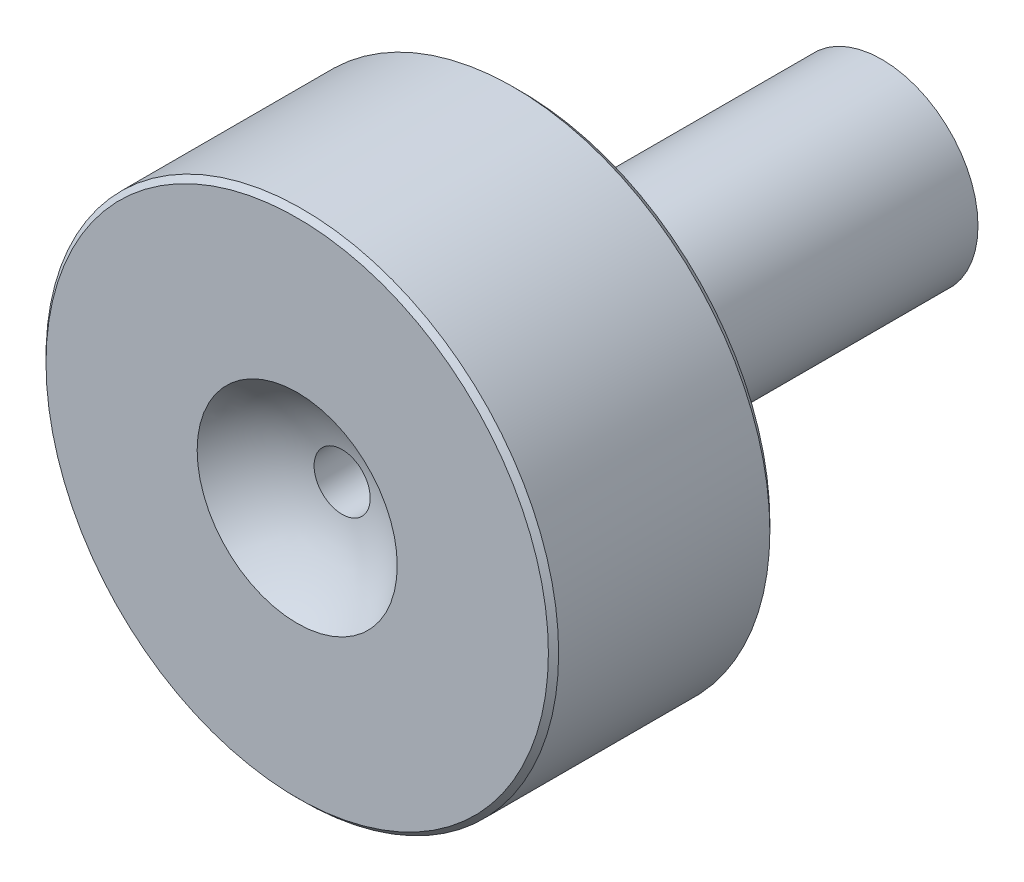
ISO-10303-21;
HEADER;
FILE_DESCRIPTION(('STEP AP214'),'2;1');
FILE_NAME('part.step','',(''),(''),'','','');
FILE_SCHEMA(('AUTOMOTIVE_DESIGN { 1 0 10303 214 1 1 1 1 }'));
ENDSEC;
DATA;
#1=APPLICATION_CONTEXT('core data for automotive mechanical design processes');
#2=APPLICATION_PROTOCOL_DEFINITION('international standard','automotive_design',2000,#1);
#3=PRODUCT_CONTEXT('',#1,'mechanical');
#4=PRODUCT('Part','Part','',(#3));
#5=PRODUCT_RELATED_PRODUCT_CATEGORY('part','',(#4));
#6=PRODUCT_DEFINITION_FORMATION('','',#4);
#7=PRODUCT_DEFINITION_CONTEXT('part definition',#1,'design');
#8=PRODUCT_DEFINITION('design','',#6,#7);
#9=PRODUCT_DEFINITION_SHAPE('','',#8);
#10=(LENGTH_UNIT() NAMED_UNIT(*) SI_UNIT(.MILLI.,.METRE.));
#11=(NAMED_UNIT(*) PLANE_ANGLE_UNIT() SI_UNIT($,.RADIAN.));
#12=(NAMED_UNIT(*) SI_UNIT($,.STERADIAN.) SOLID_ANGLE_UNIT());
#13=UNCERTAINTY_MEASURE_WITH_UNIT(LENGTH_MEASURE(1.E-05),#10,'distance_accuracy_value','');
#14=(GEOMETRIC_REPRESENTATION_CONTEXT(3) GLOBAL_UNCERTAINTY_ASSIGNED_CONTEXT((#13)) GLOBAL_UNIT_ASSIGNED_CONTEXT((#10,
#11,#12)) REPRESENTATION_CONTEXT('',''));
#15=CARTESIAN_POINT('',(0.,0.,0.));
#16=DIRECTION('',(0.,0.,1.));
#17=DIRECTION('',(1.,0.,0.));
#18=AXIS2_PLACEMENT_3D('',#15,#16,#17);
#19=CARTESIAN_POINT('',(0.,0.,22.225));
#20=DIRECTION('',(0.,0.,-1.));
#21=DIRECTION('',(-1.,0.,0.));
#22=AXIS2_PLACEMENT_3D('',#19,#20,#21);
#23=CYLINDRICAL_SURFACE('',#22,25.4);
#24=CARTESIAN_POINT('',(0.,0.,21.717));
#25=DIRECTION('',(0.,0.,1.));
#26=DIRECTION('',(1.,0.,0.));
#27=AXIS2_PLACEMENT_3D('',#24,#25,#26);
#28=CIRCLE('',#27,25.4);
#29=CARTESIAN_POINT('',(25.4,0.,21.717));
#30=VERTEX_POINT('',#29);
#31=EDGE_CURVE('E10',#30,#30,#28,.F.);
#32=ORIENTED_EDGE('',*,*,#31,.T.);
#33=EDGE_LOOP('',(#32));
#34=FACE_BOUND('',#33,.T.);
#35=CARTESIAN_POINT('',(0.,0.,0.787399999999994));
#36=DIRECTION('',(0.,0.,1.));
#37=DIRECTION('',(1.,0.,0.));
#38=AXIS2_PLACEMENT_3D('',#35,#36,#37);
#39=CIRCLE('',#38,25.4);
#40=CARTESIAN_POINT('',(25.4,0.,0.787399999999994));
#41=VERTEX_POINT('',#40);
#42=EDGE_CURVE('E46',#41,#41,#39,.T.);
#43=ORIENTED_EDGE('',*,*,#42,.T.);
#44=EDGE_LOOP('',(#43));
#45=FACE_BOUND('',#44,.T.);
#46=ADVANCED_FACE('F31',(#34,#45),#23,.T.);
#47=CARTESIAN_POINT('',(0.,0.,22.225));
#48=DIRECTION('',(0.,0.,1.));
#49=DIRECTION('',(1.,0.,0.));
#50=AXIS2_PLACEMENT_3D('',#47,#48,#49);
#51=PLANE('',#50);
#52=CARTESIAN_POINT('',(0.,0.,22.225));
#53=DIRECTION('',(0.,0.,1.));
#54=DIRECTION('',(1.,0.,0.));
#55=AXIS2_PLACEMENT_3D('',#52,#53,#54);
#56=CIRCLE('',#55,24.892);
#57=CARTESIAN_POINT('',(24.892,0.,22.225));
#58=VERTEX_POINT('',#57);
#59=EDGE_CURVE('E38',#58,#58,#56,.T.);
#60=ORIENTED_EDGE('',*,*,#59,.T.);
#61=EDGE_LOOP('',(#60));
#62=FACE_BOUND('',#61,.T.);
#63=CARTESIAN_POINT('',(0.,0.,22.225));
#64=DIRECTION('',(0.,0.,-1.));
#65=DIRECTION('',(-1.,0.,0.));
#66=AXIS2_PLACEMENT_3D('',#63,#64,#65);
#67=CIRCLE('',#66,9.91393432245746);
#68=CARTESIAN_POINT('',(9.91393432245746,0.,22.225));
#69=VERTEX_POINT('',#68);
#70=EDGE_CURVE('E60',#69,#69,#67,.T.);
#71=ORIENTED_EDGE('',*,*,#70,.T.);
#72=EDGE_LOOP('',(#71));
#73=FACE_BOUND('',#72,.T.);
#74=ADVANCED_FACE('F88',(#62,#73),#51,.T.);
#75=CARTESIAN_POINT('',(0.,0.,0.));
#76=DIRECTION('',(0.,0.,1.));
#77=DIRECTION('',(1.,0.,0.));
#78=AXIS2_PLACEMENT_3D('',#75,#76,#77);
#79=PLANE('',#78);
#80=CARTESIAN_POINT('',(0.,0.,0.));
#81=DIRECTION('',(0.,0.,1.));
#82=DIRECTION('',(1.,0.,0.));
#83=AXIS2_PLACEMENT_3D('',#80,#81,#82);
#84=CIRCLE('',#83,24.6126);
#85=CARTESIAN_POINT('',(24.6126,0.,0.));
#86=VERTEX_POINT('',#85);
#87=EDGE_CURVE('E42',#86,#86,#84,.F.);
#88=ORIENTED_EDGE('',*,*,#87,.T.);
#89=EDGE_LOOP('',(#88));
#90=FACE_BOUND('',#89,.T.);
#91=CARTESIAN_POINT('',(0.,0.,0.));
#92=DIRECTION('',(0.,0.,1.));
#93=DIRECTION('',(1.,0.,0.));
#94=AXIS2_PLACEMENT_3D('',#91,#92,#93);
#95=CIRCLE('',#94,12.7);
#96=CARTESIAN_POINT('',(12.7,0.,0.));
#97=VERTEX_POINT('',#96);
#98=EDGE_CURVE('E51',#97,#97,#95,.T.);
#99=ORIENTED_EDGE('',*,*,#98,.T.);
#100=EDGE_LOOP('',(#99));
#101=FACE_BOUND('',#100,.T.);
#102=ADVANCED_FACE('F82',(#90,#101),#79,.F.);
#103=CARTESIAN_POINT('',(0.,0.,-35.7124));
#104=DIRECTION('',(0.,0.,1.));
#105=DIRECTION('',(1.,0.,0.));
#106=AXIS2_PLACEMENT_3D('',#103,#104,#105);
#107=CYLINDRICAL_SURFACE('',#106,9.525);
#108=CARTESIAN_POINT('',(0.,0.,-3.175));
#109=DIRECTION('',(0.,0.,1.));
#110=DIRECTION('',(1.,0.,0.));
#111=AXIS2_PLACEMENT_3D('',#108,#109,#110);
#112=CIRCLE('',#111,9.525);
#113=CARTESIAN_POINT('',(9.525,0.,-3.175));
#114=VERTEX_POINT('',#113);
#115=EDGE_CURVE('E54',#114,#114,#112,.F.);
#116=ORIENTED_EDGE('',*,*,#115,.T.);
#117=EDGE_LOOP('',(#116));
#118=FACE_BOUND('',#117,.T.);
#119=CARTESIAN_POINT('',(0.,0.,-35.7124));
#120=DIRECTION('',(0.,0.,-1.));
#121=DIRECTION('',(-1.,0.,0.));
#122=AXIS2_PLACEMENT_3D('',#119,#120,#121);
#123=CIRCLE('',#122,9.525);
#124=CARTESIAN_POINT('',(-9.525,0.,-35.7124));
#125=VERTEX_POINT('',#124);
#126=EDGE_CURVE('E57',#125,#125,#123,.T.);
#127=ORIENTED_EDGE('',*,*,#126,.F.);
#128=EDGE_LOOP('',(#127));
#129=FACE_BOUND('',#128,.T.);
#130=ADVANCED_FACE('F77',(#118,#129),#107,.T.);
#131=CARTESIAN_POINT('',(0.,0.,-35.7124));
#132=DIRECTION('',(0.,0.,-1.));
#133=DIRECTION('',(-1.,0.,0.));
#134=AXIS2_PLACEMENT_3D('',#131,#132,#133);
#135=PLANE('',#134);
#136=CARTESIAN_POINT('',(0.,0.,-35.7124));
#137=DIRECTION('',(0.,0.,-1.));
#138=DIRECTION('',(-1.,0.,0.));
#139=AXIS2_PLACEMENT_3D('',#136,#137,#138);
#140=CIRCLE('',#139,3.89694388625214);
#141=CARTESIAN_POINT('',(-3.89694388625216,0.,-35.7124));
#142=VERTEX_POINT('',#141);
#143=EDGE_CURVE('E66',#142,#142,#140,.T.);
#144=ORIENTED_EDGE('',*,*,#143,.F.);
#145=EDGE_LOOP('',(#144));
#146=FACE_BOUND('',#145,.T.);
#147=ORIENTED_EDGE('',*,*,#126,.T.);
#148=EDGE_LOOP('',(#147));
#149=FACE_BOUND('',#148,.T.);
#150=ADVANCED_FACE('F73',(#146,#149),#135,.T.);
#151=CARTESIAN_POINT('',(0.,0.,30.1625));
#152=DIRECTION('',(0.,0.,-1.));
#153=DIRECTION('',(1.,0.,0.));
#154=AXIS2_PLACEMENT_3D('',#151,#152,#153);
#155=SPHERICAL_SURFACE('',#154,12.7);
#156=CARTESIAN_POINT('',(0.,0.,17.7707942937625));
#157=DIRECTION('',(0.,0.,-1.));
#158=DIRECTION('',(-1.,0.,0.));
#159=AXIS2_PLACEMENT_3D('',#156,#157,#158);
#160=CIRCLE('',#159,2.7813);
#161=CARTESIAN_POINT('',(2.78129999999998,0.,17.7707942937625));
#162=VERTEX_POINT('',#161);
#163=EDGE_CURVE('E63',#162,#162,#160,.T.);
#164=CARTESIAN_POINT('',(2.78129999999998,0.,17.7707942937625));
#165=CARTESIAN_POINT('',(2.86841312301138,0.,17.7903465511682));
#166=CARTESIAN_POINT('',(2.95531999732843,0.,17.8108176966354));
#167=CARTESIAN_POINT('',(3.12868275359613,0.,17.8535880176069));
#168=CARTESIAN_POINT('',(3.21513863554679,0.,17.8758871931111));
#169=CARTESIAN_POINT('',(3.38756091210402,0.,17.9223038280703));
#170=CARTESIAN_POINT('',(3.4735273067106,0.,17.9464212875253));
#171=CARTESIAN_POINT('',(3.64493238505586,0.,17.9964637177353));
#172=CARTESIAN_POINT('',(3.73037106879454,0.,18.0223886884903));
#173=CARTESIAN_POINT('',(3.90068272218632,0.,18.076034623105));
#174=CARTESIAN_POINT('',(3.98555569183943,0.,18.1037555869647));
#175=CARTESIAN_POINT('',(4.15469816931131,0.,18.1609811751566));
#176=CARTESIAN_POINT('',(4.23896767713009,0.,18.1904857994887));
#177=CARTESIAN_POINT('',(4.40686575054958,0.,18.2512655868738));
#178=CARTESIAN_POINT('',(4.49049431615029,0.,18.2825407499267));
#179=CARTESIAN_POINT('',(4.65707331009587,0.,18.3468477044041));
#180=CARTESIAN_POINT('',(4.74002373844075,0.,18.3798794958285));
#181=CARTESIAN_POINT('',(4.90520956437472,0.,18.4476850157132));
#182=CARTESIAN_POINT('',(4.98744496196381,0.,18.4824587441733));
#183=CARTESIAN_POINT('',(5.15116415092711,0.,18.5537326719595));
#184=CARTESIAN_POINT('',(5.23264794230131,0.,18.5902328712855));
#185=CARTESIAN_POINT('',(5.39482767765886,0.,18.6649435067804));
#186=CARTESIAN_POINT('',(5.47552362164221,0.,18.7031539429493));
#187=CARTESIAN_POINT('',(5.63609177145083,0.,18.7812680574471));
#188=CARTESIAN_POINT('',(5.71596397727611,0.,18.821171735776));
#189=CARTESIAN_POINT('',(5.87484912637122,0.,18.9026545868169));
#190=CARTESIAN_POINT('',(5.95386206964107,0.,18.9442337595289));
#191=CARTESIAN_POINT('',(6.11099355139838,0.,19.0290491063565));
#192=CARTESIAN_POINT('',(6.18911208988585,0.,19.0722852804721));
#193=CARTESIAN_POINT('',(6.34442001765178,0.,19.1603954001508));
#194=CARTESIAN_POINT('',(6.42160940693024,0.,19.2052693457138));
#195=CARTESIAN_POINT('',(6.57502470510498,0.,19.2966350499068));
#196=CARTESIAN_POINT('',(6.65125061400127,0.,19.3431268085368));
#197=CARTESIAN_POINT('',(6.80270504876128,0.,19.437707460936));
#198=CARTESIAN_POINT('',(6.877933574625,0.,19.4857963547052));
#199=CARTESIAN_POINT('',(7.02735978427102,0.,19.5835498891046));
#200=CARTESIAN_POINT('',(7.10155746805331,0.,19.6332145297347));
#201=CARTESIAN_POINT('',(7.24888899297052,0.,19.7340974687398));
#202=CARTESIAN_POINT('',(7.32202283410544,0.,19.7853157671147));
#203=CARTESIAN_POINT('',(7.46719414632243,0.,19.8892832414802));
#204=CARTESIAN_POINT('',(7.53923161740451,0.,19.9420324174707));
#205=CARTESIAN_POINT('',(7.68217814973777,0.,20.0490381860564));
#206=CARTESIAN_POINT('',(7.75308721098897,0.,20.1032947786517));
#207=CARTESIAN_POINT('',(7.89374538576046,0.,20.2132912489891));
#208=CARTESIAN_POINT('',(7.96349449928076,0.,20.2690311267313));
#209=CARTESIAN_POINT('',(8.1018017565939,0.,20.3819693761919));
#210=CARTESIAN_POINT('',(8.17035990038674,0.,20.4391677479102));
#211=CARTESIAN_POINT('',(8.30625472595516,0.,20.5549975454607));
#212=CARTESIAN_POINT('',(8.37359140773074,0.,20.6136289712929));
#213=CARTESIAN_POINT('',(8.50701336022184,0.,20.73229879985));
#214=CARTESIAN_POINT('',(8.57309863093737,0.,20.7923372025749));
#215=CARTESIAN_POINT('',(8.70398836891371,0.,20.9137942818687));
#216=CARTESIAN_POINT('',(8.76879283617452,0.,20.9752129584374));
#217=CARTESIAN_POINT('',(8.89709214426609,0.,21.0994032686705));
#218=CARTESIAN_POINT('',(8.96058698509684,0.,21.1621749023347));
#219=CARTESIAN_POINT('',(9.08623880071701,0.,21.28904320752));
#220=CARTESIAN_POINT('',(9.14839577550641,0.,21.3531398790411));
#221=CARTESIAN_POINT('',(9.27134421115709,0.,21.4826297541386));
#222=CARTESIAN_POINT('',(9.33213567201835,0.,21.5480229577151));
#223=CARTESIAN_POINT('',(9.45232605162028,0.,21.6800768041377));
#224=CARTESIAN_POINT('',(9.51172497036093,0.,21.7467374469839));
#225=CARTESIAN_POINT('',(9.62910381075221,0.,21.8812965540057));
#226=CARTESIAN_POINT('',(9.68708373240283,0.,21.9491950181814));
#227=CARTESIAN_POINT('',(9.80159892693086,0.,22.086199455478));
#228=CARTESIAN_POINT('',(9.85813419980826,0.,22.1553054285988));
#229=CARTESIAN_POINT('',(9.91393432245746,0.,22.225));
#230=B_SPLINE_CURVE_WITH_KNOTS('',3,(#164,#165,#166,#167,#168,#169,#170,#171,#172,#173,#174,
#175,#176,#177,#178,#179,#180,#181,#182,#183,#184,#185,#186,#187,#188,#189,#190,#191,#192,#193,
#194,#195,#196,#197,#198,#199,#200,#201,#202,#203,#204,#205,#206,#207,#208,#209,#210,#211,#212,
#213,#214,#215,#216,#217,#218,#219,#220,#221,#222,#223,#224,#225,#226,#227,#228,#229),
.UNSPECIFIED.,.F.,.F.,(4,2,2,2,2,2,2,2,2,2,2,2,2,2,2,2,2,2,2,2,2,2,2,2,2,2,2,2,2,2,2,2,4),(0.,
0.267836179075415,0.53567235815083,0.803508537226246,1.07134471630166,1.33918089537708,
1.6070170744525,1.87485325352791,2.14268943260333,2.41052561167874,2.67836179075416,
2.94619796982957,3.21403414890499,3.48187032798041,3.74970650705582,4.01754268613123,
4.28537886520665,4.55321504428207,4.82105122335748,5.0888874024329,5.35672358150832,
5.62455976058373,5.89239593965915,6.16023211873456,6.42806829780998,6.6959044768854,
6.96374065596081,7.23157683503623,7.49941301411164,7.76724919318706,8.03508537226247,
8.30292155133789,8.57075773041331),.UNSPECIFIED.);
#231=EDGE_CURVE('BSEAM76',#162,#69,#230,.T.);
#232=ORIENTED_EDGE('',*,*,#163,.T.);
#233=ORIENTED_EDGE('',*,*,#70,.F.);
#234=ORIENTED_EDGE('',*,*,#231,.T.);
#235=ORIENTED_EDGE('',*,*,#231,.F.);
#236=EDGE_LOOP('',(#232,#234,#233,#235));
#237=FACE_BOUND('',#236,.T.);
#238=ADVANCED_FACE('F76',(#237),#155,.F.);
#239=CARTESIAN_POINT('',(0.,0.,17.7707942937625));
#240=DIRECTION('',(0.,0.,-1.));
#241=DIRECTION('',(-1.,0.,0.));
#242=AXIS2_PLACEMENT_3D('',#239,#240,#241);
#243=CONICAL_SURFACE('',#242,2.7813,0.0208566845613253);
#244=ORIENTED_EDGE('',*,*,#143,.T.);
#245=EDGE_LOOP('',(#244));
#246=FACE_BOUND('',#245,.T.);
#247=ORIENTED_EDGE('',*,*,#163,.F.);
#248=EDGE_LOOP('',(#247));
#249=FACE_BOUND('',#248,.T.);
#250=ADVANCED_FACE('F70',(#246,#249),#243,.F.);
#251=CARTESIAN_POINT('',(0.,0.,-3.175));
#252=DIRECTION('',(0.,0.,1.));
#253=DIRECTION('',(1.,0.,0.));
#254=AXIS2_PLACEMENT_3D('',#251,#252,#253);
#255=TOROIDAL_SURFACE('',#254,12.7,3.175);
#256=ORIENTED_EDGE('',*,*,#98,.F.);
#257=EDGE_LOOP('',(#256));
#258=FACE_BOUND('',#257,.T.);
#259=ORIENTED_EDGE('',*,*,#115,.F.);
#260=EDGE_LOOP('',(#259));
#261=FACE_BOUND('',#260,.T.);
#262=ADVANCED_FACE('F99',(#258,#261),#255,.F.);
#263=CARTESIAN_POINT('',(0.,0.,0.787399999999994));
#264=DIRECTION('',(0.,0.,1.));
#265=DIRECTION('',(1.,0.,0.));
#266=AXIS2_PLACEMENT_3D('',#263,#264,#265);
#267=CONICAL_SURFACE('',#266,25.4,0.78539816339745);
#268=ORIENTED_EDGE('',*,*,#87,.F.);
#269=EDGE_LOOP('',(#268));
#270=FACE_BOUND('',#269,.T.);
#271=ORIENTED_EDGE('',*,*,#42,.F.);
#272=EDGE_LOOP('',(#271));
#273=FACE_BOUND('',#272,.T.);
#274=ADVANCED_FACE('F101',(#270,#273),#267,.T.);
#275=CARTESIAN_POINT('',(0.,0.,22.225));
#276=DIRECTION('',(0.,0.,-1.));
#277=DIRECTION('',(-1.,0.,0.));
#278=AXIS2_PLACEMENT_3D('',#275,#276,#277);
#279=CONICAL_SURFACE('',#278,24.892,0.785398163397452);
#280=ORIENTED_EDGE('',*,*,#31,.F.);
#281=EDGE_LOOP('',(#280));
#282=FACE_BOUND('',#281,.T.);
#283=ORIENTED_EDGE('',*,*,#59,.F.);
#284=EDGE_LOOP('',(#283));
#285=FACE_BOUND('',#284,.T.);
#286=ADVANCED_FACE('F33',(#282,#285),#279,.T.);
#287=CLOSED_SHELL('',(#46,#74,#102,#130,#150,#238,#250,#262,#274,#286));
#288=MANIFOLD_SOLID_BREP('B2',#287);
#289=ADVANCED_BREP_SHAPE_REPRESENTATION('',(#18,#288),#14);
#290=SHAPE_DEFINITION_REPRESENTATION(#9,#289);
ENDSEC;
END-ISO-10303-21;
